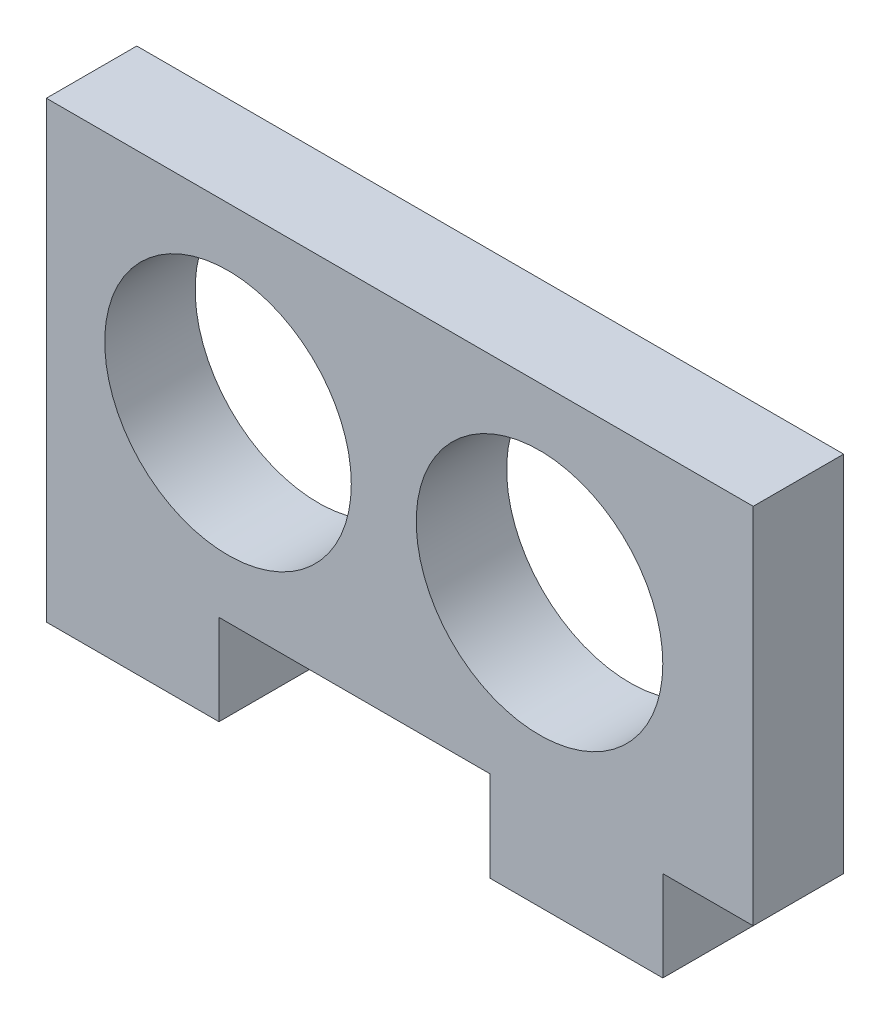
from build123d import *

# Parameters (mm, degrees)
SKETCH2_R           = 7.5
BOSS_EXTRUDE1_DEPTH = 5.5


with BuildPart() as part:
    # Sketch2 → Boss-Extrude1 (new body)
    with BuildSketch(Plane.XY):
        Polygon((-37.381272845, 27.6), (0.118727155, 27.6), (5.618727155, 27.6), (5.618727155, 19.783530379), (5.618727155, 13.316469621), (5.618727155, 5.5), (0.118727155, 5.5), (0.118727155, 0), (0, 0), (-10.381272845, 0), (-10.381272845, 5.5), (-26.881272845, 5.5), (-26.881272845, 0), (-37.381272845, 0), align=None)
        with Locations((-7.381272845, 16.55)):
            Circle(SKETCH2_R, mode=Mode.SUBTRACT)
        with Locations((-26.331272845, 16.55)):
            Circle(SKETCH2_R, mode=Mode.SUBTRACT)
    extrude(amount=BOSS_EXTRUDE1_DEPTH)


solid = part.part
